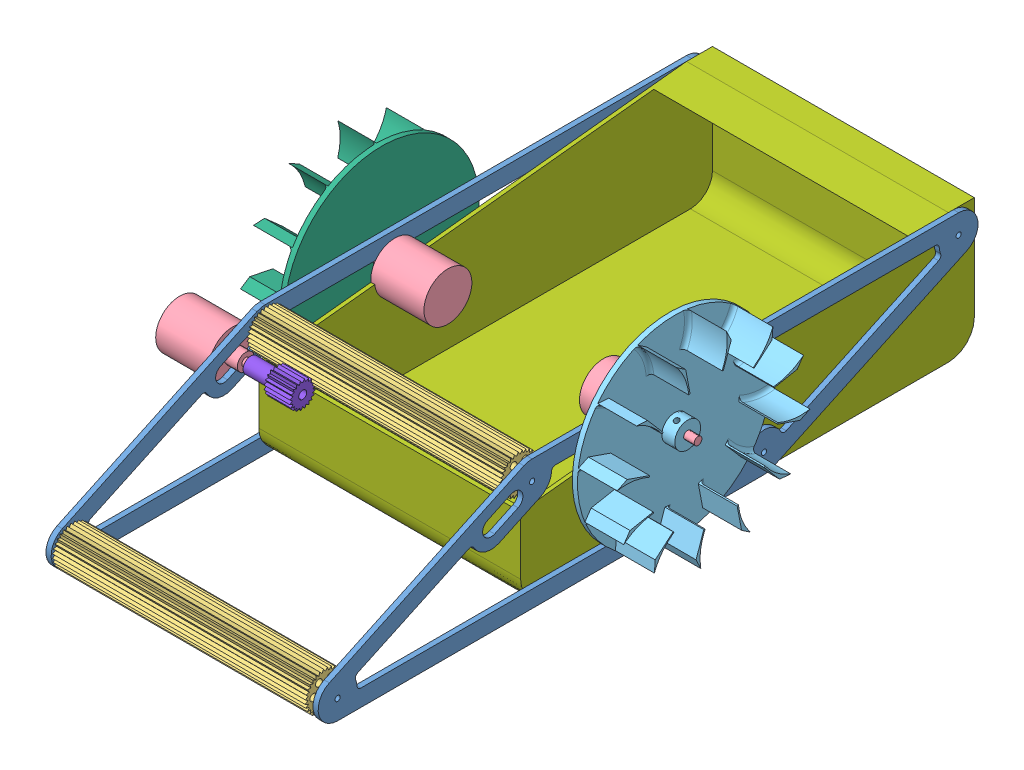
SolidWorks assembly Assem1.SLDASM, configuration Default (file format 10000). Lengths in mm.
Overall size (291 195.91 510.22).
14 component instances, 8 part files, 21 mates.
Components (placement in the parent):
- the side frame-1: the side frame.SLDPRT [Default] at (-66.3747 -37.4058 -67.3613) size (4 100 509.13)
- the side frame-2: the side frame.SLDPRT [Default] at (139.6253 -37.4058 -67.3613) size (4 100 509.13)
- free shaft-1: free shaft.SLDPRT [Default] at (-62.3747 47.5942 114.8625) x (0 0 -1) z (1 0 0) size (10 10 202)
- free shaft-2: free shaft.SLDPRT [Default] at (-62.3747 -22.4058 264.978) x (0 -0.924225 -0.381849) z (1 0 0) size (10 10 202)
- drive belt-1: drive belt.SLDPRT [Default] at (-61.3747 47.5942 114.8625) size (200 30 30)
- drive belt-2: drive belt.SLDPRT [Default] at (-61.3747 -22.4058 264.978) size (200 30 30)
- motor dummy-1: motor dummy.SLDPRT [Default] at (-21.3747 38.5942 14.8625) x (0 0.924225 0.381849) z (-1 0 0) size (37 37 73)
- motor dummy-2: motor dummy.SLDPRT [Default] at (98.6253 38.5942 14.8625) x (0 0 -1) z (1 0 0) size (37 37 73)
- water wheel mirror-3: water wheel mirror.SLDPRT [Default] at (149.6253 38.5942 14.8625) x (0 0.924225 0.381849) z (-1 0 0) size (150 150 34)
- water wheel-3: water wheel.SLDPRT [Default] at (-72.3747 38.5942 14.8625) x (0 0 1) z (-1 0 0) size (150 150 34)
- bin-1: bin.SLDPRT [Default] at (38.6253 -37.4058 -55.2449) size (202 100 350)
- motor dummy-3: motor dummy.SLDPRT [Default] at (184.6253 32.8026 146.5833) x (0 0.924225 0.381849) z (-1 0 0) size (37 37 73) (hidden)
- motor dummy-4: motor dummy.SLDPRT [Default] at (-107.3747 37.8359 135.7893) x (0 0 -1) z (1 0 0) size (37 37 73)
- gear 1-1: gear 1.SLDPRT [Default] at (-52.4646 37.8359 135.7893) x (0 0.48602 -0.873948) z (0 -0.873948 -0.48602) size (20 40 20)
Mates (geometry in assembly coordinates):
- Concentric1: concentric aligned: cylinder of the side frame-2 through (109.6253 -22.4058 264.978) axis (1 0 0) radius 2; cylinder of free shaft-2 through (114.6253 -22.4058 264.978) axis (1 0 0) radius 2
- Concentric2: concentric anti-aligned: cylinder of the side frame-2 through (173.6253 47.5942 114.8625) axis (-1 0 0) radius 2; cylinder of free shaft-1 through (114.6253 47.5942 114.8625) axis (1 0 0) radius 2
- Concentric3: concentric aligned: cylinder of the side frame-1 through (-32.3747 47.5942 114.8625) axis (-1 0 0) radius 2; cylinder of free shaft-1 through (-37.3747 47.5942 114.8625) axis (-1 0 0) radius 2
- Concentric4: concentric anti-aligned: cylinder of the side frame-1 through (-96.3747 -22.4058 264.978) axis (1 0 0) radius 2; cylinder of free shaft-2 through (-37.3747 -22.4058 264.978) axis (-1 0 0) radius 2
- Coincident1: coincident anti-aligned: plane of the side frame-1 through (-62.3747 -22.4058 -64.0359) normal (1 0 0); plane of free shaft-2 through (-62.3747 -22.4058 264.978) normal (-1 0 0)
- Coincident2: coincident anti-aligned: plane of the side frame-1 through (-62.3747 -22.4058 -64.0359) normal (1 0 0); plane of free shaft-1 through (-62.3747 47.5942 114.8625) normal (-1 0 0)
- Coincident3: coincident anti-aligned: plane of the side frame-2 through (139.6253 -22.4058 -64.0359) normal (-1 0 0); plane of free shaft-1 through (139.6253 47.5942 114.8625) normal (1 0 0)
- Coincident4: coincident aligned: plane of drive belt-1 through (-61.3747 47.5942 114.8625) normal (-1 0 0); plane of drive belt-2 through (-61.3747 -22.4058 264.978) normal (-1 0 0)
- Distance1: distance = 1 mm anti-aligned: plane of drive belt-2 through (-61.3747 -22.4058 264.978) normal (-1 0 0); plane of the side frame-1 through (-62.3747 -22.4058 -64.0359) normal (1 0 0)
- Concentric7: concentric aligned: cylinder of the side frame-1 through (-66.3747 38.5942 14.8625) axis (1 0 0) radius 6.5; cylinder of motor dummy-1 through (-72.3747 38.5942 14.8625) axis (1 0 0) radius 6.5
- Concentric8: concentric anti-aligned: cylinder of the side frame-2 through (139.6253 38.5942 14.8625) axis (1 0 0) radius 6.5; cylinder of motor dummy-2 through (149.6253 38.5942 14.8625) axis (-1 0 0) radius 6.5
- Coincident6: coincident anti-aligned: plane of the side frame-2 through (139.6253 -22.4058 -64.0359) normal (-1 0 0); plane of motor dummy-2 through (139.6253 38.5942 14.8625) normal (1 0 0)
- Coincident7: coincident anti-aligned: plane of the side frame-1 through (-62.3747 -22.4058 -64.0359) normal (1 0 0); plane of motor dummy-1 through (-62.3747 38.5942 14.8625) normal (-1 0 0)
- Distance3: distance = 8 mm aligned: plane of water wheel-3 through (-86.3747 38.5942 14.8625) normal (-1 0 0); plane of motor dummy-1 through (-94.3747 38.5942 14.8625) normal (-1 0 0)
- Distance4: distance = 8 mm aligned: plane of water wheel mirror-3 through (163.6253 38.5942 14.8625) normal (1 0 0); plane of motor dummy-2 through (171.6253 38.5942 14.8625) normal (1 0 0)
- Coincident12: coincident anti-aligned: plane of the side frame-2 through (139.6253 -22.4058 -64.0359) normal (-1 0 0); plane of bin-1 through (139.6253 62.5942 -230.2449) normal (1 0 0)
- Coincident13: coincident aligned: plane of the side frame-2 through (143.6253 -37.4058 -64.0359) normal (0 -1 0); plane of bin-1 through (38.6253 -37.4058 -55.2449) normal (0 -1 0)
- Concentric14: concentric aligned: cylinder of the side frame-2 through (139.6253 32.8026 146.5833) axis (1 0 0) radius 6.5; cylinder of motor dummy-3 through (133.6253 32.8026 146.5833) axis (1 0 0) radius 6.5
- Coincident14: coincident anti-aligned: plane of the side frame-2 through (143.6253 -22.4058 -64.0359) normal (1 0 0); plane of motor dummy-3 through (143.6253 32.8026 146.5833) normal (-1 0 0)
- Coincident15: coincident anti-aligned: plane of the side frame-1 through (-66.3747 -22.4058 -64.0359) normal (-1 0 0); plane of motor dummy-4 through (-66.3747 37.8359 135.7893) normal (1 0 0)
- Tangent1: tangent anti-aligned: plane of the side frame-1 through (-66.3747 26.9116 143.8363) normal (0 0.906308 0.422618); cylinder of motor dummy-4 through (-56.3747 37.8359 135.7893) axis (-1 0 0) radius 6.5
